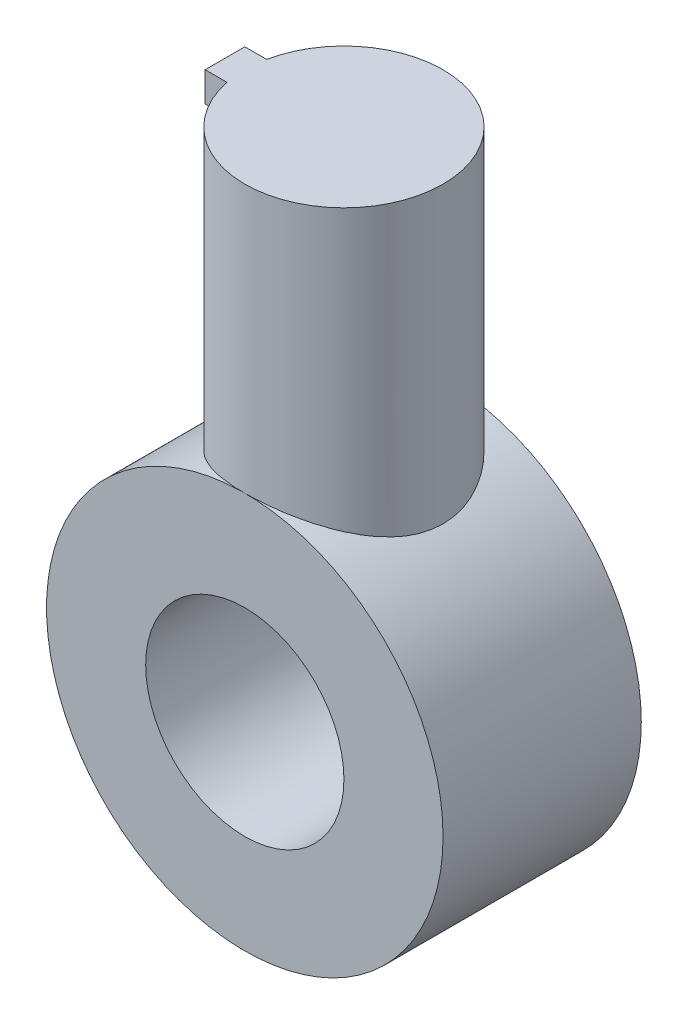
ISO-10303-21;
HEADER;
FILE_DESCRIPTION(('STEP AP214'),'2;1');
FILE_NAME('part.step','',(''),(''),'','','');
FILE_SCHEMA(('AUTOMOTIVE_DESIGN { 1 0 10303 214 1 1 1 1 }'));
ENDSEC;
DATA;
#1=APPLICATION_CONTEXT('core data for automotive mechanical design processes');
#2=APPLICATION_PROTOCOL_DEFINITION('international standard','automotive_design',2000,#1);
#3=PRODUCT_CONTEXT('',#1,'mechanical');
#4=PRODUCT('Part','Part','',(#3));
#5=PRODUCT_RELATED_PRODUCT_CATEGORY('part','',(#4));
#6=PRODUCT_DEFINITION_FORMATION('','',#4);
#7=PRODUCT_DEFINITION_CONTEXT('part definition',#1,'design');
#8=PRODUCT_DEFINITION('design','',#6,#7);
#9=PRODUCT_DEFINITION_SHAPE('','',#8);
#10=(LENGTH_UNIT() NAMED_UNIT(*) SI_UNIT(.MILLI.,.METRE.));
#11=(NAMED_UNIT(*) PLANE_ANGLE_UNIT() SI_UNIT($,.RADIAN.));
#12=(NAMED_UNIT(*) SI_UNIT($,.STERADIAN.) SOLID_ANGLE_UNIT());
#13=UNCERTAINTY_MEASURE_WITH_UNIT(LENGTH_MEASURE(1.E-05),#10,'distance_accuracy_value','');
#14=(GEOMETRIC_REPRESENTATION_CONTEXT(3) GLOBAL_UNCERTAINTY_ASSIGNED_CONTEXT((#13)) GLOBAL_UNIT_ASSIGNED_CONTEXT((#10,
#11,#12)) REPRESENTATION_CONTEXT('',''));
#15=CARTESIAN_POINT('',(0.,0.,0.));
#16=DIRECTION('',(0.,0.,1.));
#17=DIRECTION('',(1.,0.,0.));
#18=AXIS2_PLACEMENT_3D('',#15,#16,#17);
#19=CARTESIAN_POINT('',(0.,47.,10.));
#20=DIRECTION('',(0.,-1.,0.));
#21=DIRECTION('',(0.,0.,-1.));
#22=AXIS2_PLACEMENT_3D('',#19,#20,#21);
#23=CYLINDRICAL_SURFACE('',#22,10.);
#24=CARTESIAN_POINT('',(0.,17.,10.));
#25=DIRECTION('',(0.,1.,0.));
#26=DIRECTION('',(0.,0.,1.));
#27=AXIS2_PLACEMENT_3D('',#24,#25,#26);
#28=CIRCLE('',#27,10.);
#29=CARTESIAN_POINT('',(0.,17.,20.));
#30=VERTEX_POINT('',#29);
#31=EDGE_CURVE('E54',#30,#30,#28,.T.);
#32=ORIENTED_EDGE('',*,*,#31,.T.);
#33=EDGE_LOOP('',(#32));
#34=FACE_BOUND('',#33,.T.);
#35=DIRECTION('',(0.,1.,0.));
#36=VECTOR('',#35,1.);
#37=CARTESIAN_POINT('',(-9.79795897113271,44.,12.));
#38=LINE('',#37,#36);
#39=CARTESIAN_POINT('',(-9.79795897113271,44.,12.));
#40=VERTEX_POINT('',#39);
#41=CARTESIAN_POINT('',(-9.79795897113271,47.,12.));
#42=VERTEX_POINT('',#41);
#43=EDGE_CURVE('E108',#40,#42,#38,.T.);
#44=ORIENTED_EDGE('',*,*,#43,.F.);
#45=CARTESIAN_POINT('',(0.,44.,10.));
#46=DIRECTION('',(0.,1.,0.));
#47=DIRECTION('',(0.,0.,1.));
#48=AXIS2_PLACEMENT_3D('',#45,#46,#47);
#49=CIRCLE('',#48,10.);
#50=CARTESIAN_POINT('',(-9.79795897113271,44.,8.));
#51=VERTEX_POINT('',#50);
#52=EDGE_CURVE('E95',#51,#40,#49,.T.);
#53=ORIENTED_EDGE('',*,*,#52,.F.);
#54=DIRECTION('',(0.,1.,0.));
#55=VECTOR('',#54,1.);
#56=CARTESIAN_POINT('',(-9.79795897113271,44.,8.));
#57=LINE('',#56,#55);
#58=CARTESIAN_POINT('',(-9.79795897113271,47.,8.));
#59=VERTEX_POINT('',#58);
#60=EDGE_CURVE('E100',#51,#59,#57,.T.);
#61=ORIENTED_EDGE('',*,*,#60,.T.);
#62=CARTESIAN_POINT('',(0.,47.,10.));
#63=DIRECTION('',(0.,1.,0.));
#64=DIRECTION('',(0.,0.,1.));
#65=AXIS2_PLACEMENT_3D('',#62,#63,#64);
#66=CIRCLE('',#65,10.);
#67=EDGE_CURVE('E12',#42,#59,#66,.T.);
#68=ORIENTED_EDGE('',*,*,#67,.F.);
#69=EDGE_LOOP('',(#44,#53,#61,#68));
#70=FACE_BOUND('',#69,.T.);
#71=ADVANCED_FACE('F51',(#34,#70),#23,.T.);
#72=CARTESIAN_POINT('',(0.,47.,10.));
#73=DIRECTION('',(0.,1.,0.));
#74=DIRECTION('',(0.,0.,1.));
#75=AXIS2_PLACEMENT_3D('',#72,#73,#74);
#76=PLANE('',#75);
#77=ORIENTED_EDGE('',*,*,#67,.T.);
#78=DIRECTION('',(-1.,0.,0.));
#79=VECTOR('',#78,1.);
#80=CARTESIAN_POINT('',(0.,47.,8.));
#81=LINE('',#80,#79);
#82=CARTESIAN_POINT('',(-12.,47.,8.));
#83=VERTEX_POINT('',#82);
#84=EDGE_CURVE('E104',#59,#83,#81,.T.);
#85=ORIENTED_EDGE('',*,*,#84,.T.);
#86=DIRECTION('',(0.,0.,1.));
#87=VECTOR('',#86,1.);
#88=CARTESIAN_POINT('',(-12.,47.,0.));
#89=LINE('',#88,#87);
#90=CARTESIAN_POINT('',(-12.,47.,12.));
#91=VERTEX_POINT('',#90);
#92=EDGE_CURVE('E115',#83,#91,#89,.T.);
#93=ORIENTED_EDGE('',*,*,#92,.T.);
#94=DIRECTION('',(-1.,0.,0.));
#95=VECTOR('',#94,1.);
#96=CARTESIAN_POINT('',(0.,47.,12.));
#97=LINE('',#96,#95);
#98=EDGE_CURVE('E64',#42,#91,#97,.T.);
#99=ORIENTED_EDGE('',*,*,#98,.F.);
#100=EDGE_LOOP('',(#77,#85,#93,#99));
#101=FACE_BOUND('',#100,.T.);
#102=ADVANCED_FACE('F126',(#101),#76,.T.);
#103=CARTESIAN_POINT('',(0.,17.,10.));
#104=DIRECTION('',(0.,1.,0.));
#105=DIRECTION('',(0.,0.,1.));
#106=AXIS2_PLACEMENT_3D('',#103,#104,#105);
#107=PLANE('',#106);
#108=ORIENTED_EDGE('',*,*,#31,.F.);
#109=EDGE_LOOP('',(#108));
#110=FACE_BOUND('',#109,.T.);
#111=ADVANCED_FACE('F135',(#110),#107,.F.);
#112=CARTESIAN_POINT('',(0.,44.,12.));
#113=DIRECTION('',(0.,0.,-1.));
#114=DIRECTION('',(-1.,0.,0.));
#115=AXIS2_PLACEMENT_3D('',#112,#113,#114);
#116=PLANE('',#115);
#117=ORIENTED_EDGE('',*,*,#98,.T.);
#118=DIRECTION('',(0.,1.,0.));
#119=VECTOR('',#118,1.);
#120=CARTESIAN_POINT('',(-12.,44.,12.));
#121=LINE('',#120,#119);
#122=CARTESIAN_POINT('',(-12.,44.,12.));
#123=VERTEX_POINT('',#122);
#124=EDGE_CURVE('E91',#123,#91,#121,.T.);
#125=ORIENTED_EDGE('',*,*,#124,.F.);
#126=DIRECTION('',(-1.,0.,0.));
#127=VECTOR('',#126,1.);
#128=CARTESIAN_POINT('',(0.,44.,12.));
#129=LINE('',#128,#127);
#130=EDGE_CURVE('E73',#40,#123,#129,.T.);
#131=ORIENTED_EDGE('',*,*,#130,.F.);
#132=ORIENTED_EDGE('',*,*,#43,.T.);
#133=EDGE_LOOP('',(#117,#125,#131,#132));
#134=FACE_BOUND('',#133,.T.);
#135=ADVANCED_FACE('F125',(#134),#116,.F.);
#136=CARTESIAN_POINT('',(-12.,44.,0.));
#137=DIRECTION('',(-1.,0.,0.));
#138=DIRECTION('',(0.,0.,1.));
#139=AXIS2_PLACEMENT_3D('',#136,#137,#138);
#140=PLANE('',#139);
#141=ORIENTED_EDGE('',*,*,#92,.F.);
#142=DIRECTION('',(0.,1.,0.));
#143=VECTOR('',#142,1.);
#144=CARTESIAN_POINT('',(-12.,44.,8.));
#145=LINE('',#144,#143);
#146=CARTESIAN_POINT('',(-12.,44.,8.));
#147=VERTEX_POINT('',#146);
#148=EDGE_CURVE('E107',#147,#83,#145,.T.);
#149=ORIENTED_EDGE('',*,*,#148,.F.);
#150=DIRECTION('',(0.,0.,1.));
#151=VECTOR('',#150,1.);
#152=CARTESIAN_POINT('',(-12.,44.,0.));
#153=LINE('',#152,#151);
#154=EDGE_CURVE('E111',#147,#123,#153,.T.);
#155=ORIENTED_EDGE('',*,*,#154,.T.);
#156=ORIENTED_EDGE('',*,*,#124,.T.);
#157=EDGE_LOOP('',(#141,#149,#155,#156));
#158=FACE_BOUND('',#157,.T.);
#159=ADVANCED_FACE('F127',(#158),#140,.T.);
#160=CARTESIAN_POINT('',(0.,44.,8.));
#161=DIRECTION('',(0.,0.,-1.));
#162=DIRECTION('',(-1.,0.,0.));
#163=AXIS2_PLACEMENT_3D('',#160,#161,#162);
#164=PLANE('',#163);
#165=ORIENTED_EDGE('',*,*,#84,.F.);
#166=ORIENTED_EDGE('',*,*,#60,.F.);
#167=DIRECTION('',(-1.,0.,0.));
#168=VECTOR('',#167,1.);
#169=CARTESIAN_POINT('',(0.,44.,8.));
#170=LINE('',#169,#168);
#171=EDGE_CURVE('E102',#51,#147,#170,.T.);
#172=ORIENTED_EDGE('',*,*,#171,.T.);
#173=ORIENTED_EDGE('',*,*,#148,.T.);
#174=EDGE_LOOP('',(#165,#166,#172,#173));
#175=FACE_BOUND('',#174,.T.);
#176=ADVANCED_FACE('F101',(#175),#164,.T.);
#177=CARTESIAN_POINT('',(0.,44.,0.));
#178=DIRECTION('',(0.,1.,0.));
#179=DIRECTION('',(0.,0.,1.));
#180=AXIS2_PLACEMENT_3D('',#177,#178,#179);
#181=PLANE('',#180);
#182=ORIENTED_EDGE('',*,*,#130,.T.);
#183=ORIENTED_EDGE('',*,*,#154,.F.);
#184=ORIENTED_EDGE('',*,*,#171,.F.);
#185=ORIENTED_EDGE('',*,*,#52,.T.);
#186=EDGE_LOOP('',(#182,#183,#184,#185));
#187=FACE_BOUND('',#186,.T.);
#188=ADVANCED_FACE('F110',(#187),#181,.F.);
#189=CLOSED_SHELL('',(#71,#102,#111,#135,#159,#176,#188));
#190=MANIFOLD_SOLID_BREP('B2',#189);
#191=CARTESIAN_POINT('',(0.,0.,20.));
#192=DIRECTION('',(0.,0.,1.));
#193=DIRECTION('',(1.,0.,0.));
#194=AXIS2_PLACEMENT_3D('',#191,#192,#193);
#195=PLANE('',#194);
#196=CARTESIAN_POINT('',(0.,0.,20.));
#197=DIRECTION('',(0.,0.,1.));
#198=DIRECTION('',(1.,0.,0.));
#199=AXIS2_PLACEMENT_3D('',#196,#197,#198);
#200=CIRCLE('',#199,20.);
#201=CARTESIAN_POINT('',(20.,0.,20.));
#202=VERTEX_POINT('',#201);
#203=EDGE_CURVE('E50',#202,#202,#200,.T.);
#204=ORIENTED_EDGE('',*,*,#203,.T.);
#205=EDGE_LOOP('',(#204));
#206=FACE_BOUND('',#205,.T.);
#207=CARTESIAN_POINT('',(0.,0.,20.));
#208=DIRECTION('',(0.,0.,1.));
#209=DIRECTION('',(1.,0.,0.));
#210=AXIS2_PLACEMENT_3D('',#207,#208,#209);
#211=CIRCLE('',#210,10.);
#212=CARTESIAN_POINT('',(10.,0.,20.));
#213=VERTEX_POINT('',#212);
#214=EDGE_CURVE('E204',#213,#213,#211,.T.);
#215=ORIENTED_EDGE('',*,*,#214,.F.);
#216=EDGE_LOOP('',(#215));
#217=FACE_BOUND('',#216,.T.);
#218=ADVANCED_FACE('F193',(#206,#217),#195,.T.);
#219=CARTESIAN_POINT('',(0.,0.,0.));
#220=DIRECTION('',(0.,0.,1.));
#221=DIRECTION('',(1.,0.,0.));
#222=AXIS2_PLACEMENT_3D('',#219,#220,#221);
#223=PLANE('',#222);
#224=CARTESIAN_POINT('',(0.,0.,0.));
#225=DIRECTION('',(0.,0.,1.));
#226=DIRECTION('',(1.,0.,0.));
#227=AXIS2_PLACEMENT_3D('',#224,#225,#226);
#228=CIRCLE('',#227,20.);
#229=CARTESIAN_POINT('',(20.,0.,0.));
#230=VERTEX_POINT('',#229);
#231=EDGE_CURVE('E197',#230,#230,#228,.T.);
#232=ORIENTED_EDGE('',*,*,#231,.F.);
#233=EDGE_LOOP('',(#232));
#234=FACE_BOUND('',#233,.T.);
#235=CARTESIAN_POINT('',(0.,0.,0.));
#236=DIRECTION('',(0.,0.,1.));
#237=DIRECTION('',(1.,0.,0.));
#238=AXIS2_PLACEMENT_3D('',#235,#236,#237);
#239=CIRCLE('',#238,10.);
#240=CARTESIAN_POINT('',(10.,0.,0.));
#241=VERTEX_POINT('',#240);
#242=EDGE_CURVE('E206',#241,#241,#239,.T.);
#243=ORIENTED_EDGE('',*,*,#242,.T.);
#244=EDGE_LOOP('',(#243));
#245=FACE_BOUND('',#244,.T.);
#246=ADVANCED_FACE('F216',(#234,#245),#223,.F.);
#247=CARTESIAN_POINT('',(0.,0.,20.));
#248=DIRECTION('',(0.,0.,-1.));
#249=DIRECTION('',(-1.,0.,0.));
#250=AXIS2_PLACEMENT_3D('',#247,#248,#249);
#251=CYLINDRICAL_SURFACE('',#250,20.);
#252=ORIENTED_EDGE('',*,*,#203,.F.);
#253=EDGE_LOOP('',(#252));
#254=FACE_BOUND('',#253,.T.);
#255=ORIENTED_EDGE('',*,*,#231,.T.);
#256=EDGE_LOOP('',(#255));
#257=FACE_BOUND('',#256,.T.);
#258=ADVANCED_FACE('F195',(#254,#257),#251,.T.);
#259=CARTESIAN_POINT('',(0.,0.,20.));
#260=DIRECTION('',(0.,0.,-1.));
#261=DIRECTION('',(-1.,0.,0.));
#262=AXIS2_PLACEMENT_3D('',#259,#260,#261);
#263=CYLINDRICAL_SURFACE('',#262,10.);
#264=ORIENTED_EDGE('',*,*,#214,.T.);
#265=EDGE_LOOP('',(#264));
#266=FACE_BOUND('',#265,.T.);
#267=ORIENTED_EDGE('',*,*,#242,.F.);
#268=EDGE_LOOP('',(#267));
#269=FACE_BOUND('',#268,.T.);
#270=ADVANCED_FACE('F212',(#266,#269),#263,.F.);
#271=CLOSED_SHELL('',(#218,#246,#258,#270));
#272=MANIFOLD_SOLID_BREP('B6',#271);
#273=ADVANCED_BREP_SHAPE_REPRESENTATION('',(#18,#190,#272),#14);
#274=SHAPE_DEFINITION_REPRESENTATION(#9,#273);
ENDSEC;
END-ISO-10303-21;
